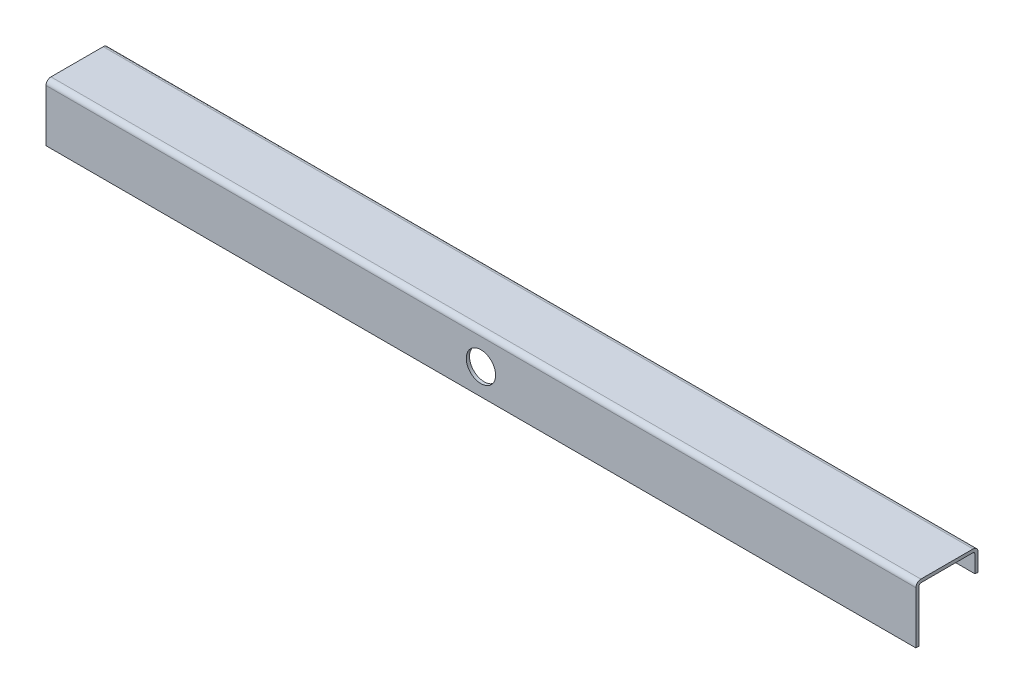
ISO-10303-21;
HEADER;
FILE_DESCRIPTION(('STEP AP214'),'2;1');
FILE_NAME('part.step','',(''),(''),'','','');
FILE_SCHEMA(('AUTOMOTIVE_DESIGN { 1 0 10303 214 1 1 1 1 }'));
ENDSEC;
DATA;
#1=APPLICATION_CONTEXT('core data for automotive mechanical design processes');
#2=APPLICATION_PROTOCOL_DEFINITION('international standard','automotive_design',2000,#1);
#3=PRODUCT_CONTEXT('',#1,'mechanical');
#4=PRODUCT('Part','Part','',(#3));
#5=PRODUCT_RELATED_PRODUCT_CATEGORY('part','',(#4));
#6=PRODUCT_DEFINITION_FORMATION('','',#4);
#7=PRODUCT_DEFINITION_CONTEXT('part definition',#1,'design');
#8=PRODUCT_DEFINITION('design','',#6,#7);
#9=PRODUCT_DEFINITION_SHAPE('','',#8);
#10=(LENGTH_UNIT() NAMED_UNIT(*) SI_UNIT(.MILLI.,.METRE.));
#11=(NAMED_UNIT(*) PLANE_ANGLE_UNIT() SI_UNIT($,.RADIAN.));
#12=(NAMED_UNIT(*) SI_UNIT($,.STERADIAN.) SOLID_ANGLE_UNIT());
#13=UNCERTAINTY_MEASURE_WITH_UNIT(LENGTH_MEASURE(1.E-05),#10,'distance_accuracy_value','');
#14=(GEOMETRIC_REPRESENTATION_CONTEXT(3) GLOBAL_UNCERTAINTY_ASSIGNED_CONTEXT((#13)) GLOBAL_UNIT_ASSIGNED_CONTEXT((#10,
#11,#12)) REPRESENTATION_CONTEXT('',''));
#15=CARTESIAN_POINT('',(0.,0.,0.));
#16=DIRECTION('',(0.,0.,1.));
#17=DIRECTION('',(1.,0.,0.));
#18=AXIS2_PLACEMENT_3D('',#15,#16,#17);
#19=CARTESIAN_POINT('',(177.8,22.6100351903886,12.5324354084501));
#20=DIRECTION('',(0.,0.978147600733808,-0.207911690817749));
#21=DIRECTION('',(0.,0.207911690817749,0.978147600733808));
#22=AXIS2_PLACEMENT_3D('',#19,#20,#21);
#23=PLANE('',#22);
#24=DIRECTION('',(-1.,0.,0.));
#25=VECTOR('',#24,1.);
#26=CARTESIAN_POINT('',(177.8,22.6100351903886,12.5324354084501));
#27=LINE('',#26,#25);
#28=CARTESIAN_POINT('',(177.8,22.6100351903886,12.5324354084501));
#29=VERTEX_POINT('',#28);
#30=CARTESIAN_POINT('',(91.3118069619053,22.6100351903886,12.5324354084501));
#31=VERTEX_POINT('',#30);
#32=EDGE_CURVE('E153',#29,#31,#27,.T.);
#33=ORIENTED_EDGE('',*,*,#32,.T.);
#34=CARTESIAN_POINT('',(88.9,20.8258863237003,4.13867493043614));
#35=DIRECTION('',(0.,0.978147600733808,-0.207911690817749));
#36=DIRECTION('',(0.,0.207911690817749,0.978147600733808));
#37=AXIS2_PLACEMENT_3D('',#34,#35,#36);
#38=ELLIPSE('',#37,14.4292030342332,3.00000000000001);
#39=CARTESIAN_POINT('',(91.4095813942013,22.4696628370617,11.8720354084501));
#40=VERTEX_POINT('',#39);
#41=EDGE_CURVE('E56',#31,#40,#38,.T.);
#42=ORIENTED_EDGE('',*,*,#41,.T.);
#43=DIRECTION('',(-1.,0.,0.));
#44=VECTOR('',#43,1.);
#45=CARTESIAN_POINT('',(177.8,22.4696628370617,11.8720354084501));
#46=LINE('',#45,#44);
#47=CARTESIAN_POINT('',(177.8,22.4696628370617,11.8720354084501));
#48=VERTEX_POINT('',#47);
#49=EDGE_CURVE('E49',#48,#40,#46,.T.);
#50=ORIENTED_EDGE('',*,*,#49,.F.);
#51=DIRECTION('',(0.,-0.207911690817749,-0.978147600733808));
#52=VECTOR('',#51,1.);
#53=CARTESIAN_POINT('',(177.8,22.6100351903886,12.5324354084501));
#54=LINE('',#53,#52);
#55=EDGE_CURVE('E166',#29,#48,#54,.T.);
#56=ORIENTED_EDGE('',*,*,#55,.F.);
#57=EDGE_LOOP('',(#33,#42,#50,#56));
#58=FACE_BOUND('',#57,.T.);
#59=ADVANCED_FACE('F41',(#58),#23,.F.);
#60=CARTESIAN_POINT('',(86.3904186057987,22.4696628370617,11.8720354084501));
#61=VERTEX_POINT('',#60);
#62=CARTESIAN_POINT('',(0.,22.4696628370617,11.8720354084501));
#63=VERTEX_POINT('',#62);
#64=EDGE_CURVE('E159',#61,#63,#46,.T.);
#65=ORIENTED_EDGE('',*,*,#64,.F.);
#66=CARTESIAN_POINT('',(86.4881930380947,22.6100351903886,12.5324354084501));
#67=VERTEX_POINT('',#66);
#68=EDGE_CURVE('E143',#61,#67,#38,.T.);
#69=ORIENTED_EDGE('',*,*,#68,.T.);
#70=CARTESIAN_POINT('',(0.,22.6100351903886,12.5324354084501));
#71=VERTEX_POINT('',#70);
#72=EDGE_CURVE('E171',#67,#71,#27,.T.);
#73=ORIENTED_EDGE('',*,*,#72,.T.);
#74=DIRECTION('',(0.,-0.207911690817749,-0.978147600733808));
#75=VECTOR('',#74,1.);
#76=CARTESIAN_POINT('',(0.,22.6100351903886,12.5324354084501));
#77=LINE('',#76,#75);
#78=EDGE_CURVE('E164',#71,#63,#77,.T.);
#79=ORIENTED_EDGE('',*,*,#78,.T.);
#80=EDGE_LOOP('',(#65,#69,#73,#79));
#81=FACE_BOUND('',#80,.T.);
#82=ADVANCED_FACE('F243',(#81),#23,.F.);
#83=CARTESIAN_POINT('',(177.8,22.4696628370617,11.8720354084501));
#84=DIRECTION('',(0.,0.,1.));
#85=DIRECTION('',(1.,0.,0.));
#86=AXIS2_PLACEMENT_3D('',#83,#84,#85);
#87=PLANE('',#86);
#88=ORIENTED_EDGE('',*,*,#49,.T.);
#89=CARTESIAN_POINT('',(88.9,20.8258863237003,11.8720354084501));
#90=DIRECTION('',(0.,0.,1.));
#91=DIRECTION('',(1.,0.,0.));
#92=AXIS2_PLACEMENT_3D('',#89,#90,#91);
#93=CIRCLE('',#92,3.00000000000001);
#94=EDGE_CURVE('E140',#40,#61,#93,.T.);
#95=ORIENTED_EDGE('',*,*,#94,.T.);
#96=ORIENTED_EDGE('',*,*,#64,.T.);
#97=DIRECTION('',(0.,1.,0.));
#98=VECTOR('',#97,1.);
#99=CARTESIAN_POINT('',(0.,22.4696628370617,11.8720354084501));
#100=LINE('',#99,#98);
#101=CARTESIAN_POINT('',(0.,26.1598863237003,11.8720354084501));
#102=VERTEX_POINT('',#101);
#103=EDGE_CURVE('E172',#63,#102,#100,.T.);
#104=ORIENTED_EDGE('',*,*,#103,.T.);
#105=DIRECTION('',(-1.,0.,0.));
#106=VECTOR('',#105,1.);
#107=CARTESIAN_POINT('',(177.8,26.1598863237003,11.8720354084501));
#108=LINE('',#107,#106);
#109=CARTESIAN_POINT('',(177.8,26.1598863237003,11.8720354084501));
#110=VERTEX_POINT('',#109);
#111=EDGE_CURVE('E161',#110,#102,#108,.T.);
#112=ORIENTED_EDGE('',*,*,#111,.F.);
#113=DIRECTION('',(0.,1.,0.));
#114=VECTOR('',#113,1.);
#115=CARTESIAN_POINT('',(177.8,22.4696628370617,11.8720354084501));
#116=LINE('',#115,#114);
#117=EDGE_CURVE('E158',#48,#110,#116,.T.);
#118=ORIENTED_EDGE('',*,*,#117,.F.);
#119=EDGE_LOOP('',(#88,#95,#96,#104,#112,#118));
#120=FACE_BOUND('',#119,.T.);
#121=ADVANCED_FACE('F156',(#120),#87,.F.);
#122=CARTESIAN_POINT('',(177.8,26.1598863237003,12.8880354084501));
#123=DIRECTION('',(-1.,0.,0.));
#124=DIRECTION('',(0.,0.,1.));
#125=AXIS2_PLACEMENT_3D('',#122,#123,#124);
#126=CYLINDRICAL_SURFACE('',#125,1.016);
#127=CARTESIAN_POINT('',(0.,26.1598863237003,12.8880354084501));
#128=DIRECTION('',(1.,0.,0.));
#129=DIRECTION('',(0.,0.,-1.));
#130=AXIS2_PLACEMENT_3D('',#127,#128,#129);
#131=CIRCLE('',#130,1.016);
#132=CARTESIAN_POINT('',(0.,27.1758863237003,12.8880354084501));
#133=VERTEX_POINT('',#132);
#134=EDGE_CURVE('E174',#102,#133,#131,.T.);
#135=ORIENTED_EDGE('',*,*,#134,.T.);
#136=DIRECTION('',(-1.,0.,0.));
#137=VECTOR('',#136,1.);
#138=CARTESIAN_POINT('',(177.8,27.1758863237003,12.8880354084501));
#139=LINE('',#138,#137);
#140=CARTESIAN_POINT('',(177.8,27.1758863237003,12.8880354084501));
#141=VERTEX_POINT('',#140);
#142=EDGE_CURVE('E177',#141,#133,#139,.T.);
#143=ORIENTED_EDGE('',*,*,#142,.F.);
#144=CARTESIAN_POINT('',(177.8,26.1598863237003,12.8880354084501));
#145=DIRECTION('',(1.,0.,0.));
#146=DIRECTION('',(0.,0.,-1.));
#147=AXIS2_PLACEMENT_3D('',#144,#145,#146);
#148=CIRCLE('',#147,1.016);
#149=EDGE_CURVE('E179',#110,#141,#148,.T.);
#150=ORIENTED_EDGE('',*,*,#149,.F.);
#151=ORIENTED_EDGE('',*,*,#111,.T.);
#152=EDGE_LOOP('',(#135,#143,#150,#151));
#153=FACE_BOUND('',#152,.T.);
#154=ADVANCED_FACE('F302',(#153),#126,.T.);
#155=CARTESIAN_POINT('',(177.8,27.1758863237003,12.8880354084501));
#156=DIRECTION('',(0.,-1.,0.));
#157=DIRECTION('',(0.,0.,-1.));
#158=AXIS2_PLACEMENT_3D('',#155,#156,#157);
#159=PLANE('',#158);
#160=DIRECTION('',(0.,0.,1.));
#161=VECTOR('',#160,1.);
#162=CARTESIAN_POINT('',(0.,27.1758863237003,12.8880354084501));
#163=LINE('',#162,#161);
#164=CARTESIAN_POINT('',(0.,27.1758863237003,23.5560354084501));
#165=VERTEX_POINT('',#164);
#166=EDGE_CURVE('E181',#133,#165,#163,.T.);
#167=ORIENTED_EDGE('',*,*,#166,.T.);
#168=DIRECTION('',(-1.,0.,0.));
#169=VECTOR('',#168,1.);
#170=CARTESIAN_POINT('',(177.8,27.1758863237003,23.5560354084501));
#171=LINE('',#170,#169);
#172=CARTESIAN_POINT('',(177.8,27.1758863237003,23.5560354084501));
#173=VERTEX_POINT('',#172);
#174=EDGE_CURVE('E184',#173,#165,#171,.T.);
#175=ORIENTED_EDGE('',*,*,#174,.F.);
#176=DIRECTION('',(0.,0.,1.));
#177=VECTOR('',#176,1.);
#178=CARTESIAN_POINT('',(177.8,27.1758863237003,12.8880354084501));
#179=LINE('',#178,#177);
#180=EDGE_CURVE('E186',#141,#173,#179,.T.);
#181=ORIENTED_EDGE('',*,*,#180,.F.);
#182=ORIENTED_EDGE('',*,*,#142,.T.);
#183=EDGE_LOOP('',(#167,#175,#181,#182));
#184=FACE_BOUND('',#183,.T.);
#185=ADVANCED_FACE('F298',(#184),#159,.F.);
#186=CARTESIAN_POINT('',(177.8,26.1598863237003,23.5560354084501));
#187=DIRECTION('',(-1.,0.,0.));
#188=DIRECTION('',(0.,0.,1.));
#189=AXIS2_PLACEMENT_3D('',#186,#187,#188);
#190=CYLINDRICAL_SURFACE('',#189,1.016);
#191=CARTESIAN_POINT('',(0.,26.1598863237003,23.5560354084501));
#192=DIRECTION('',(1.,0.,0.));
#193=DIRECTION('',(0.,0.,-1.));
#194=AXIS2_PLACEMENT_3D('',#191,#192,#193);
#195=CIRCLE('',#194,1.01599999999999);
#196=CARTESIAN_POINT('',(0.,26.1598863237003,24.5720354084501));
#197=VERTEX_POINT('',#196);
#198=EDGE_CURVE('E188',#165,#197,#195,.T.);
#199=ORIENTED_EDGE('',*,*,#198,.T.);
#200=DIRECTION('',(-1.,0.,0.));
#201=VECTOR('',#200,1.);
#202=CARTESIAN_POINT('',(177.8,26.1598863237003,24.5720354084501));
#203=LINE('',#202,#201);
#204=CARTESIAN_POINT('',(177.8,26.1598863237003,24.5720354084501));
#205=VERTEX_POINT('',#204);
#206=EDGE_CURVE('E191',#205,#197,#203,.T.);
#207=ORIENTED_EDGE('',*,*,#206,.F.);
#208=CARTESIAN_POINT('',(177.8,26.1598863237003,23.5560354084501));
#209=DIRECTION('',(1.,0.,0.));
#210=DIRECTION('',(0.,0.,-1.));
#211=AXIS2_PLACEMENT_3D('',#208,#209,#210);
#212=CIRCLE('',#211,1.01599999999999);
#213=EDGE_CURVE('E193',#173,#205,#212,.T.);
#214=ORIENTED_EDGE('',*,*,#213,.F.);
#215=ORIENTED_EDGE('',*,*,#174,.T.);
#216=EDGE_LOOP('',(#199,#207,#214,#215));
#217=FACE_BOUND('',#216,.T.);
#218=ADVANCED_FACE('F267',(#217),#190,.T.);
#219=CARTESIAN_POINT('',(177.8,26.1598863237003,24.5720354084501));
#220=DIRECTION('',(0.,0.,-1.));
#221=DIRECTION('',(0.,1.,0.));
#222=AXIS2_PLACEMENT_3D('',#219,#220,#221);
#223=PLANE('',#222);
#224=CARTESIAN_POINT('',(88.9,20.8258863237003,24.5720354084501));
#225=DIRECTION('',(0.,0.,1.));
#226=DIRECTION('',(1.,0.,0.));
#227=AXIS2_PLACEMENT_3D('',#224,#225,#226);
#228=CIRCLE('',#227,3.00000000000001);
#229=CARTESIAN_POINT('',(91.9,20.8258863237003,24.5720354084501));
#230=VERTEX_POINT('',#229);
#231=EDGE_CURVE('E147',#230,#230,#228,.T.);
#232=ORIENTED_EDGE('',*,*,#231,.F.);
#233=EDGE_LOOP('',(#232));
#234=FACE_BOUND('',#233,.T.);
#235=DIRECTION('',(0.,-1.,0.));
#236=VECTOR('',#235,1.);
#237=CARTESIAN_POINT('',(0.,26.1598863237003,24.5720354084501));
#238=LINE('',#237,#236);
#239=CARTESIAN_POINT('',(0.,15.4918863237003,24.5720354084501));
#240=VERTEX_POINT('',#239);
#241=EDGE_CURVE('E195',#197,#240,#238,.T.);
#242=ORIENTED_EDGE('',*,*,#241,.T.);
#243=DIRECTION('',(-1.,0.,0.));
#244=VECTOR('',#243,1.);
#245=CARTESIAN_POINT('',(177.8,15.4918863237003,24.5720354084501));
#246=LINE('',#245,#244);
#247=CARTESIAN_POINT('',(177.8,15.4918863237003,24.5720354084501));
#248=VERTEX_POINT('',#247);
#249=EDGE_CURVE('E198',#248,#240,#246,.T.);
#250=ORIENTED_EDGE('',*,*,#249,.F.);
#251=DIRECTION('',(0.,-1.,0.));
#252=VECTOR('',#251,1.);
#253=CARTESIAN_POINT('',(177.8,26.1598863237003,24.5720354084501));
#254=LINE('',#253,#252);
#255=EDGE_CURVE('E200',#205,#248,#254,.T.);
#256=ORIENTED_EDGE('',*,*,#255,.F.);
#257=ORIENTED_EDGE('',*,*,#206,.T.);
#258=EDGE_LOOP('',(#242,#250,#256,#257));
#259=FACE_BOUND('',#258,.T.);
#260=ADVANCED_FACE('F263',(#234,#259),#223,.F.);
#261=CARTESIAN_POINT('',(177.8,15.4918863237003,24.5720354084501));
#262=DIRECTION('',(0.,1.,0.));
#263=DIRECTION('',(0.,0.,1.));
#264=AXIS2_PLACEMENT_3D('',#261,#262,#263);
#265=PLANE('',#264);
#266=DIRECTION('',(0.,0.,-1.));
#267=VECTOR('',#266,1.);
#268=CARTESIAN_POINT('',(0.,15.4918863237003,24.5720354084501));
#269=LINE('',#268,#267);
#270=CARTESIAN_POINT('',(0.,15.4918863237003,23.9116354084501));
#271=VERTEX_POINT('',#270);
#272=EDGE_CURVE('E202',#240,#271,#269,.T.);
#273=ORIENTED_EDGE('',*,*,#272,.T.);
#274=DIRECTION('',(-1.,0.,0.));
#275=VECTOR('',#274,1.);
#276=CARTESIAN_POINT('',(177.8,15.4918863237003,23.9116354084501));
#277=LINE('',#276,#275);
#278=CARTESIAN_POINT('',(177.8,15.4918863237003,23.9116354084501));
#279=VERTEX_POINT('',#278);
#280=EDGE_CURVE('E205',#279,#271,#277,.T.);
#281=ORIENTED_EDGE('',*,*,#280,.F.);
#282=DIRECTION('',(0.,0.,-1.));
#283=VECTOR('',#282,1.);
#284=CARTESIAN_POINT('',(177.8,15.4918863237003,24.5720354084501));
#285=LINE('',#284,#283);
#286=EDGE_CURVE('E207',#248,#279,#285,.T.);
#287=ORIENTED_EDGE('',*,*,#286,.F.);
#288=ORIENTED_EDGE('',*,*,#249,.T.);
#289=EDGE_LOOP('',(#273,#281,#287,#288));
#290=FACE_BOUND('',#289,.T.);
#291=ADVANCED_FACE('F266',(#290),#265,.F.);
#292=CARTESIAN_POINT('',(177.8,26.1598863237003,23.9116354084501));
#293=DIRECTION('',(0.,0.,1.));
#294=DIRECTION('',(1.,0.,0.));
#295=AXIS2_PLACEMENT_3D('',#292,#293,#294);
#296=PLANE('',#295);
#297=CARTESIAN_POINT('',(88.9,20.8258863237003,23.9116354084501));
#298=DIRECTION('',(0.,0.,1.));
#299=DIRECTION('',(1.,0.,0.));
#300=AXIS2_PLACEMENT_3D('',#297,#298,#299);
#301=CIRCLE('',#300,3.00000000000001);
#302=CARTESIAN_POINT('',(91.9,20.8258863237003,23.9116354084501));
#303=VERTEX_POINT('',#302);
#304=EDGE_CURVE('E154',#303,#303,#301,.T.);
#305=ORIENTED_EDGE('',*,*,#304,.T.);
#306=EDGE_LOOP('',(#305));
#307=FACE_BOUND('',#306,.T.);
#308=DIRECTION('',(0.,1.,0.));
#309=VECTOR('',#308,1.);
#310=CARTESIAN_POINT('',(0.,26.1598863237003,23.9116354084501));
#311=LINE('',#310,#309);
#312=CARTESIAN_POINT('',(0.,26.1598863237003,23.9116354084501));
#313=VERTEX_POINT('',#312);
#314=EDGE_CURVE('E209',#271,#313,#311,.T.);
#315=ORIENTED_EDGE('',*,*,#314,.T.);
#316=DIRECTION('',(-1.,0.,0.));
#317=VECTOR('',#316,1.);
#318=CARTESIAN_POINT('',(177.8,26.1598863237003,23.9116354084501));
#319=LINE('',#318,#317);
#320=CARTESIAN_POINT('',(177.8,26.1598863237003,23.9116354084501));
#321=VERTEX_POINT('',#320);
#322=EDGE_CURVE('E212',#321,#313,#319,.T.);
#323=ORIENTED_EDGE('',*,*,#322,.F.);
#324=DIRECTION('',(0.,1.,0.));
#325=VECTOR('',#324,1.);
#326=CARTESIAN_POINT('',(177.8,26.1598863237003,23.9116354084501));
#327=LINE('',#326,#325);
#328=EDGE_CURVE('E214',#279,#321,#327,.T.);
#329=ORIENTED_EDGE('',*,*,#328,.F.);
#330=ORIENTED_EDGE('',*,*,#280,.T.);
#331=EDGE_LOOP('',(#315,#323,#329,#330));
#332=FACE_BOUND('',#331,.T.);
#333=ADVANCED_FACE('F283',(#307,#332),#296,.F.);
#334=CARTESIAN_POINT('',(177.8,26.1598863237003,23.5560354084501));
#335=DIRECTION('',(-1.,0.,0.));
#336=DIRECTION('',(0.,0.,1.));
#337=AXIS2_PLACEMENT_3D('',#334,#335,#336);
#338=CYLINDRICAL_SURFACE('',#337,0.355600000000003);
#339=CARTESIAN_POINT('',(0.,26.1598863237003,23.5560354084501));
#340=DIRECTION('',(-1.,0.,0.));
#341=DIRECTION('',(0.,0.,1.));
#342=AXIS2_PLACEMENT_3D('',#339,#340,#341);
#343=CIRCLE('',#342,0.355600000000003);
#344=CARTESIAN_POINT('',(0.,26.5154863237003,23.5560354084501));
#345=VERTEX_POINT('',#344);
#346=EDGE_CURVE('E216',#313,#345,#343,.T.);
#347=ORIENTED_EDGE('',*,*,#346,.T.);
#348=DIRECTION('',(-1.,0.,0.));
#349=VECTOR('',#348,1.);
#350=CARTESIAN_POINT('',(177.8,26.5154863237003,23.5560354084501));
#351=LINE('',#350,#349);
#352=CARTESIAN_POINT('',(177.8,26.5154863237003,23.5560354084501));
#353=VERTEX_POINT('',#352);
#354=EDGE_CURVE('E219',#353,#345,#351,.T.);
#355=ORIENTED_EDGE('',*,*,#354,.F.);
#356=CARTESIAN_POINT('',(177.8,26.1598863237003,23.5560354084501));
#357=DIRECTION('',(-1.,1.33244463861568E-13,1.3324446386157E-13));
#358=DIRECTION('',(1.3324446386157E-13,0.,1.));
#359=AXIS2_PLACEMENT_3D('',#356,#357,#358);
#360=CIRCLE('',#359,0.355600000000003);
#361=EDGE_CURVE('E221',#321,#353,#360,.T.);
#362=ORIENTED_EDGE('',*,*,#361,.F.);
#363=ORIENTED_EDGE('',*,*,#322,.T.);
#364=EDGE_LOOP('',(#347,#355,#362,#363));
#365=FACE_BOUND('',#364,.T.);
#366=ADVANCED_FACE('F287',(#365),#338,.F.);
#367=CARTESIAN_POINT('',(177.8,26.5154863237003,12.8880354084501));
#368=DIRECTION('',(0.,1.,0.));
#369=DIRECTION('',(0.,0.,1.));
#370=AXIS2_PLACEMENT_3D('',#367,#368,#369);
#371=PLANE('',#370);
#372=DIRECTION('',(0.,0.,-1.));
#373=VECTOR('',#372,1.);
#374=CARTESIAN_POINT('',(0.,26.5154863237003,12.8880354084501));
#375=LINE('',#374,#373);
#376=CARTESIAN_POINT('',(0.,26.5154863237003,12.8880354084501));
#377=VERTEX_POINT('',#376);
#378=EDGE_CURVE('E223',#345,#377,#375,.T.);
#379=ORIENTED_EDGE('',*,*,#378,.T.);
#380=DIRECTION('',(-1.,0.,0.));
#381=VECTOR('',#380,1.);
#382=CARTESIAN_POINT('',(177.8,26.5154863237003,12.8880354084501));
#383=LINE('',#382,#381);
#384=CARTESIAN_POINT('',(177.8,26.5154863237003,12.8880354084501));
#385=VERTEX_POINT('',#384);
#386=EDGE_CURVE('E226',#385,#377,#383,.T.);
#387=ORIENTED_EDGE('',*,*,#386,.F.);
#388=DIRECTION('',(0.,0.,-1.));
#389=VECTOR('',#388,1.);
#390=CARTESIAN_POINT('',(177.8,26.5154863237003,12.8880354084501));
#391=LINE('',#390,#389);
#392=EDGE_CURVE('E228',#353,#385,#391,.T.);
#393=ORIENTED_EDGE('',*,*,#392,.F.);
#394=ORIENTED_EDGE('',*,*,#354,.T.);
#395=EDGE_LOOP('',(#379,#387,#393,#394));
#396=FACE_BOUND('',#395,.T.);
#397=ADVANCED_FACE('F335',(#396),#371,.F.);
#398=CARTESIAN_POINT('',(177.8,26.1598863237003,12.8880354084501));
#399=DIRECTION('',(-1.,0.,0.));
#400=DIRECTION('',(0.,0.,1.));
#401=AXIS2_PLACEMENT_3D('',#398,#399,#400);
#402=CYLINDRICAL_SURFACE('',#401,0.3556);
#403=CARTESIAN_POINT('',(0.,26.1598863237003,12.8880354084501));
#404=DIRECTION('',(-1.,0.,0.));
#405=DIRECTION('',(0.,0.,1.));
#406=AXIS2_PLACEMENT_3D('',#403,#404,#405);
#407=CIRCLE('',#406,0.355600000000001);
#408=CARTESIAN_POINT('',(0.,26.1598863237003,12.5324354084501));
#409=VERTEX_POINT('',#408);
#410=EDGE_CURVE('E230',#377,#409,#407,.T.);
#411=ORIENTED_EDGE('',*,*,#410,.T.);
#412=DIRECTION('',(-1.,0.,0.));
#413=VECTOR('',#412,1.);
#414=CARTESIAN_POINT('',(177.8,26.1598863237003,12.5324354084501));
#415=LINE('',#414,#413);
#416=CARTESIAN_POINT('',(177.8,26.1598863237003,12.5324354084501));
#417=VERTEX_POINT('',#416);
#418=EDGE_CURVE('E170',#417,#409,#415,.T.);
#419=ORIENTED_EDGE('',*,*,#418,.F.);
#420=CARTESIAN_POINT('',(177.8,26.1598863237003,12.8880354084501));
#421=DIRECTION('',(-1.,0.,0.));
#422=DIRECTION('',(0.,0.,1.));
#423=AXIS2_PLACEMENT_3D('',#420,#421,#422);
#424=CIRCLE('',#423,0.355600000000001);
#425=EDGE_CURVE('E234',#385,#417,#424,.T.);
#426=ORIENTED_EDGE('',*,*,#425,.F.);
#427=ORIENTED_EDGE('',*,*,#386,.T.);
#428=EDGE_LOOP('',(#411,#419,#426,#427));
#429=FACE_BOUND('',#428,.T.);
#430=ADVANCED_FACE('F331',(#429),#402,.F.);
#431=CARTESIAN_POINT('',(177.8,22.6100351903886,12.5324354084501));
#432=DIRECTION('',(0.,0.,-1.));
#433=DIRECTION('',(0.,1.,0.));
#434=AXIS2_PLACEMENT_3D('',#431,#432,#433);
#435=PLANE('',#434);
#436=ORIENTED_EDGE('',*,*,#72,.F.);
#437=CARTESIAN_POINT('',(88.9,20.8258863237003,12.5324354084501));
#438=DIRECTION('',(0.,0.,-1.));
#439=DIRECTION('',(0.,1.,0.));
#440=AXIS2_PLACEMENT_3D('',#437,#438,#439);
#441=CIRCLE('',#440,3.00000000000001);
#442=EDGE_CURVE('E11',#67,#31,#441,.T.);
#443=ORIENTED_EDGE('',*,*,#442,.T.);
#444=ORIENTED_EDGE('',*,*,#32,.F.);
#445=DIRECTION('',(0.,-1.,0.));
#446=VECTOR('',#445,1.);
#447=CARTESIAN_POINT('',(177.8,22.6100351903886,12.5324354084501));
#448=LINE('',#447,#446);
#449=EDGE_CURVE('E63',#417,#29,#448,.T.);
#450=ORIENTED_EDGE('',*,*,#449,.F.);
#451=ORIENTED_EDGE('',*,*,#418,.T.);
#452=DIRECTION('',(0.,-1.,0.));
#453=VECTOR('',#452,1.);
#454=CARTESIAN_POINT('',(0.,22.6100351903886,12.5324354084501));
#455=LINE('',#454,#453);
#456=EDGE_CURVE('E168',#409,#71,#455,.T.);
#457=ORIENTED_EDGE('',*,*,#456,.T.);
#458=EDGE_LOOP('',(#436,#443,#444,#450,#451,#457));
#459=FACE_BOUND('',#458,.T.);
#460=ADVANCED_FACE('F247',(#459),#435,.F.);
#461=CARTESIAN_POINT('',(177.8,26.1598863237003,12.8880354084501));
#462=DIRECTION('',(1.,0.,0.));
#463=DIRECTION('',(0.,0.,-1.));
#464=AXIS2_PLACEMENT_3D('',#461,#462,#463);
#465=PLANE('',#464);
#466=ORIENTED_EDGE('',*,*,#55,.T.);
#467=ORIENTED_EDGE('',*,*,#117,.T.);
#468=ORIENTED_EDGE('',*,*,#149,.T.);
#469=ORIENTED_EDGE('',*,*,#180,.T.);
#470=ORIENTED_EDGE('',*,*,#213,.T.);
#471=ORIENTED_EDGE('',*,*,#255,.T.);
#472=ORIENTED_EDGE('',*,*,#286,.T.);
#473=ORIENTED_EDGE('',*,*,#328,.T.);
#474=ORIENTED_EDGE('',*,*,#361,.T.);
#475=ORIENTED_EDGE('',*,*,#392,.T.);
#476=ORIENTED_EDGE('',*,*,#425,.T.);
#477=ORIENTED_EDGE('',*,*,#449,.T.);
#478=EDGE_LOOP('',(#466,#467,#468,#469,#470,#471,#472,#473,#474,#475,#476,#477));
#479=FACE_BOUND('',#478,.T.);
#480=ADVANCED_FACE('F290',(#479),#465,.T.);
#481=CARTESIAN_POINT('',(0.,26.1598863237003,12.8880354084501));
#482=DIRECTION('',(1.,0.,0.));
#483=DIRECTION('',(0.,0.,-1.));
#484=AXIS2_PLACEMENT_3D('',#481,#482,#483);
#485=PLANE('',#484);
#486=ORIENTED_EDGE('',*,*,#78,.F.);
#487=ORIENTED_EDGE('',*,*,#456,.F.);
#488=ORIENTED_EDGE('',*,*,#410,.F.);
#489=ORIENTED_EDGE('',*,*,#378,.F.);
#490=ORIENTED_EDGE('',*,*,#346,.F.);
#491=ORIENTED_EDGE('',*,*,#314,.F.);
#492=ORIENTED_EDGE('',*,*,#272,.F.);
#493=ORIENTED_EDGE('',*,*,#241,.F.);
#494=ORIENTED_EDGE('',*,*,#198,.F.);
#495=ORIENTED_EDGE('',*,*,#166,.F.);
#496=ORIENTED_EDGE('',*,*,#134,.F.);
#497=ORIENTED_EDGE('',*,*,#103,.F.);
#498=EDGE_LOOP('',(#486,#487,#488,#489,#490,#491,#492,#493,#494,#495,#496,#497));
#499=FACE_BOUND('',#498,.T.);
#500=ADVANCED_FACE('F43',(#499),#485,.F.);
#501=CARTESIAN_POINT('',(88.9,20.8258863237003,11.8720354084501));
#502=DIRECTION('',(0.,0.,1.));
#503=DIRECTION('',(1.,0.,0.));
#504=AXIS2_PLACEMENT_3D('',#501,#502,#503);
#505=CYLINDRICAL_SURFACE('',#504,3.00000000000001);
#506=ORIENTED_EDGE('',*,*,#442,.F.);
#507=ORIENTED_EDGE('',*,*,#68,.F.);
#508=ORIENTED_EDGE('',*,*,#94,.F.);
#509=ORIENTED_EDGE('',*,*,#41,.F.);
#510=EDGE_LOOP('',(#506,#507,#508,#509));
#511=FACE_BOUND('',#510,.T.);
#512=ADVANCED_FACE('F141',(#511),#505,.F.);
#513=ORIENTED_EDGE('',*,*,#231,.T.);
#514=EDGE_LOOP('',(#513));
#515=FACE_BOUND('',#514,.T.);
#516=ORIENTED_EDGE('',*,*,#304,.F.);
#517=EDGE_LOOP('',(#516));
#518=FACE_BOUND('',#517,.T.);
#519=ADVANCED_FACE('F260',(#515,#518),#505,.F.);
#520=CLOSED_SHELL('',(#59,#82,#121,#154,#185,#218,#260,#291,#333,#366,#397,#430,#460,#480,#500,
#512,#519));
#521=MANIFOLD_SOLID_BREP('B2',#520);
#522=ADVANCED_BREP_SHAPE_REPRESENTATION('',(#18,#521),#14);
#523=SHAPE_DEFINITION_REPRESENTATION(#9,#522);
ENDSEC;
END-ISO-10303-21;
